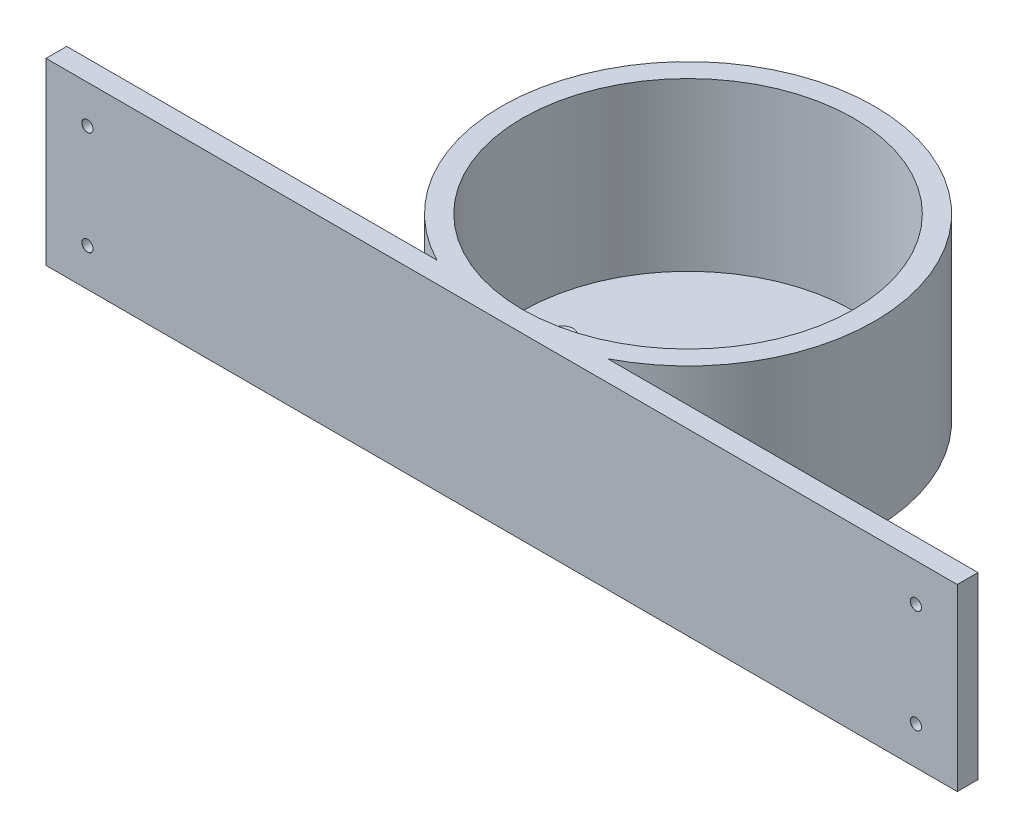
from build123d import *

# Parameters (mm, degrees)
SKETCH2_R                                      = 57.15
BOSS_EXTRUDE1_DEPTH                            = 3.81
SKETCH3_R                                      = 57.15
SKETCH3_R_2                                    = 50.8
BOSS_EXTRUDE2_DEPTH                            = 51.181
CUT_EXTRUDE1_DEPTH                             = 98.756099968
CUT_EXTRUDE1_DEPTH_BACK                        = 98.756099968
SKETCH4_W                                      = 13.208
SKETCH4_H                                      = 11.176
CSK_FOR_M3_FLAT_HEAD_MACHINE_SCREW1_AT_2_COUNT = 2
CSK_FOR_M3_FLAT_HEAD_MACHINE_SCREW1_AT_2_PITCH = 76.708
SKETCH9_W                                      = 279.4
SKETCH9_H                                      = 54.991
BOSS_EXTRUDE4_DEPTH                            = 6.35
CSK_FOR_M3_FLAT_HEAD_MACHINE_SCREW2_AT_2_COUNT = 2
CSK_FOR_M3_FLAT_HEAD_MACHINE_SCREW2_AT_2_PITCH = 31.75
CSK_FOR_M3_FLAT_HEAD_MACHINE_SCREW2_AT_3_COUNT = 2
CSK_FOR_M3_FLAT_HEAD_MACHINE_SCREW2_AT_3_PITCH = 254
CSK_FOR_M3_FLAT_HEAD_MACHINE_SCREW2_AT_4_COUNT = 2
CSK_FOR_M3_FLAT_HEAD_MACHINE_SCREW2_AT_4_PITCH = 255.976683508


with BuildPart() as part:
    # Sketch2 → Boss-Extrude1 (new body)
    with BuildSketch(Plane(origin=(0, 0, 0), x_dir=(1, 0, 0), z_dir=(0, 1, 0))):
        with Locations(Location((0, 0, 0), (0, 0, 90))):
            Circle(SKETCH2_R)
    extrude(amount=BOSS_EXTRUDE1_DEPTH)

    # Sketch3 → Boss-Extrude2 (add)
    with BuildSketch(Plane(origin=(0, 3.81, 0), x_dir=(1, 0, 0), z_dir=(0, 1, 0))):
        with Locations(Location((0, 0, 0), (0, 0, 90))):
            Circle(SKETCH3_R)
        with Locations(Location((0, 0, 0), (0, 0, 90))):
            Circle(SKETCH3_R_2, mode=Mode.SUBTRACT)
    extrude(amount=BOSS_EXTRUDE2_DEPTH)

    # Sketch4 → Cut-Extrude1 (cut, two sides: drawn at the far end of the back side and taken through both)
    with BuildSketch(Plane.XZ.offset(-CUT_EXTRUDE1_DEPTH_BACK)):
        Rectangle(SKETCH4_W, SKETCH4_H)
    extrude(amount=CUT_EXTRUDE1_DEPTH + CUT_EXTRUDE1_DEPTH_BACK, mode=Mode.SUBTRACT)

    # Sketch7 → CSK for M3 Flat Head Machine Screw1 (revolve, cut)
    with BuildSketch(Plane(origin=(-38.354, 3.81, 0), x_dir=(0, 0, 1), z_dir=(1, 0, 0))):
        Polygon((0, 0), (0, 3.81), (1.725, 3.81), (1.7, 3.785), (1.7, 1.45), (3.15, 0), align=None)
    csk_for_m3_flat_head_machine_screw1 = revolve(axis=Axis((-38.354, 10.16, 0), (0, -1, 0)), mode=Mode.SUBTRACT)

    # CSK for M3 Flat Head Machine Screw1 at 2: CSK for M3 Flat Head Machine Screw1 ×2
    with Locations(*[(i * CSK_FOR_M3_FLAT_HEAD_MACHINE_SCREW1_AT_2_PITCH, 0, 0) for i in range(1, CSK_FOR_M3_FLAT_HEAD_MACHINE_SCREW1_AT_2_COUNT)]):
        add(csk_for_m3_flat_head_machine_screw1, mode=Mode.SUBTRACT)

    # Sketch9 → Boss-Extrude4 (add)
    with BuildSketch(Plane(origin=(0, 0, 50.8), x_dir=(-1, 0, 0), z_dir=(0, 0, -1))):
        with Locations((0, 27.4955)):
            Rectangle(SKETCH9_W, SKETCH9_H)
    extrude(amount=-BOSS_EXTRUDE4_DEPTH)

    # Sketch11 → CSK for M3 Flat Head Machine Screw2 (revolve, cut)
    with BuildSketch(Plane(origin=(127, 43.3705, 50.8), x_dir=(0, 1, 0), z_dir=(1, 0, 0))):
        Polygon((0, 0), (0, 6.35), (1.725, 6.35), (1.7, 6.325), (1.7, 1.45), (3.15, 0), align=None)
    csk_for_m3_flat_head_machine_screw2 = revolve(axis=Axis((127, 43.3705, 44.45), (0, 0, 1)), mode=Mode.SUBTRACT)

    # CSK for M3 Flat Head Machine Screw2 at 2: CSK for M3 Flat Head Machine Screw2 ×2
    with Locations(*[(0, -i * CSK_FOR_M3_FLAT_HEAD_MACHINE_SCREW2_AT_2_PITCH, 0) for i in range(1, CSK_FOR_M3_FLAT_HEAD_MACHINE_SCREW2_AT_2_COUNT)]):
        add(csk_for_m3_flat_head_machine_screw2, mode=Mode.SUBTRACT)

    # CSK for M3 Flat Head Machine Screw2 at 3: CSK for M3 Flat Head Machine Screw2 ×2
    with Locations(*[(-i * CSK_FOR_M3_FLAT_HEAD_MACHINE_SCREW2_AT_3_PITCH, 0, 0) for i in range(1, CSK_FOR_M3_FLAT_HEAD_MACHINE_SCREW2_AT_3_COUNT)]):
        add(csk_for_m3_flat_head_machine_screw2, mode=Mode.SUBTRACT)

    # CSK for M3 Flat Head Machine Screw2 at 4: CSK for M3 Flat Head Machine Screw2 ×2
    with Locations(*[Vector(-0.9922778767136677, -0.12403473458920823, 0) * (i * CSK_FOR_M3_FLAT_HEAD_MACHINE_SCREW2_AT_4_PITCH) for i in range(1, CSK_FOR_M3_FLAT_HEAD_MACHINE_SCREW2_AT_4_COUNT)]):
        add(csk_for_m3_flat_head_machine_screw2, mode=Mode.SUBTRACT)


solid = part.part
